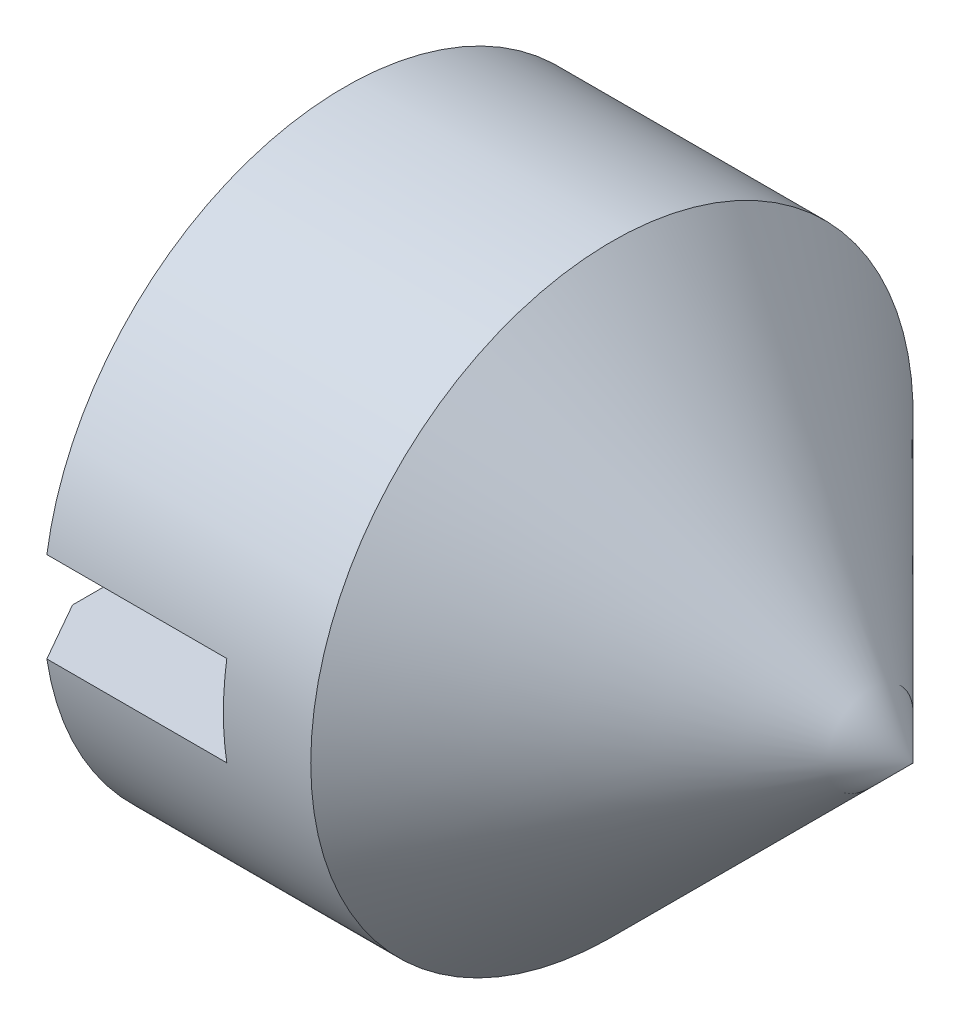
ISO-10303-21;
HEADER;
FILE_DESCRIPTION(('STEP AP214'),'2;1');
FILE_NAME('part.step','',(''),(''),'','','');
FILE_SCHEMA(('AUTOMOTIVE_DESIGN { 1 0 10303 214 1 1 1 1 }'));
ENDSEC;
DATA;
#1=APPLICATION_CONTEXT('core data for automotive mechanical design processes');
#2=APPLICATION_PROTOCOL_DEFINITION('international standard','automotive_design',2000,#1);
#3=PRODUCT_CONTEXT('',#1,'mechanical');
#4=PRODUCT('Part','Part','',(#3));
#5=PRODUCT_RELATED_PRODUCT_CATEGORY('part','',(#4));
#6=PRODUCT_DEFINITION_FORMATION('','',#4);
#7=PRODUCT_DEFINITION_CONTEXT('part definition',#1,'design');
#8=PRODUCT_DEFINITION('design','',#6,#7);
#9=PRODUCT_DEFINITION_SHAPE('','',#8);
#10=(LENGTH_UNIT() NAMED_UNIT(*) SI_UNIT(.MILLI.,.METRE.));
#11=(NAMED_UNIT(*) PLANE_ANGLE_UNIT() SI_UNIT($,.RADIAN.));
#12=(NAMED_UNIT(*) SI_UNIT($,.STERADIAN.) SOLID_ANGLE_UNIT());
#13=UNCERTAINTY_MEASURE_WITH_UNIT(LENGTH_MEASURE(1.E-05),#10,'distance_accuracy_value','');
#14=(GEOMETRIC_REPRESENTATION_CONTEXT(3) GLOBAL_UNCERTAINTY_ASSIGNED_CONTEXT((#13)) GLOBAL_UNIT_ASSIGNED_CONTEXT((#10,
#11,#12)) REPRESENTATION_CONTEXT('',''));
#15=CARTESIAN_POINT('',(0.,0.,0.));
#16=DIRECTION('',(0.,0.,1.));
#17=DIRECTION('',(1.,0.,0.));
#18=AXIS2_PLACEMENT_3D('',#15,#16,#17);
#19=CARTESIAN_POINT('',(0.,0.,0.));
#20=DIRECTION('',(-1.,0.,0.));
#21=DIRECTION('',(0.,0.,1.));
#22=AXIS2_PLACEMENT_3D('',#19,#20,#21);
#23=PLANE('',#22);
#24=CARTESIAN_POINT('',(0.,0.,0.));
#25=DIRECTION('',(-1.,0.,0.));
#26=DIRECTION('',(0.,0.,1.));
#27=AXIS2_PLACEMENT_3D('',#24,#25,#26);
#28=CIRCLE('',#27,1.61);
#29=CARTESIAN_POINT('',(0.,-0.3,-1.58180276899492));
#30=VERTEX_POINT('',#29);
#31=CARTESIAN_POINT('',(0.,-0.3,1.58180276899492));
#32=VERTEX_POINT('',#31);
#33=EDGE_CURVE('E158',#30,#32,#28,.T.);
#34=ORIENTED_EDGE('',*,*,#33,.T.);
#35=DIRECTION('',(0.,0.,-1.));
#36=VECTOR('',#35,1.);
#37=CARTESIAN_POINT('',(0.,-0.3,2.));
#38=LINE('',#37,#36);
#39=EDGE_CURVE('E114',#32,#30,#38,.T.);
#40=ORIENTED_EDGE('',*,*,#39,.T.);
#41=EDGE_LOOP('',(#34,#40));
#42=FACE_BOUND('',#41,.T.);
#43=ADVANCED_FACE('F35',(#42),#23,.T.);
#44=CARTESIAN_POINT('',(0.,0.,0.));
#45=DIRECTION('',(1.,0.,0.));
#46=DIRECTION('',(0.,0.,-1.));
#47=AXIS2_PLACEMENT_3D('',#44,#45,#46);
#48=CONICAL_SURFACE('',#47,1.61,1.0471975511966);
#49=CARTESIAN_POINT('',(0.225166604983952,0.,0.));
#50=DIRECTION('',(-1.,0.,0.));
#51=DIRECTION('',(0.,0.,1.));
#52=AXIS2_PLACEMENT_3D('',#49,#50,#51);
#53=CIRCLE('',#52,2.);
#54=CARTESIAN_POINT('',(0.225166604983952,-0.3,-1.97737199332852));
#55=VERTEX_POINT('',#54);
#56=CARTESIAN_POINT('',(0.225166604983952,-0.3,1.97737199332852));
#57=VERTEX_POINT('',#56);
#58=EDGE_CURVE('E163',#55,#57,#53,.T.);
#59=ORIENTED_EDGE('',*,*,#58,.T.);
#60=CARTESIAN_POINT('',(1.61900888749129,-0.299999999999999,4.4039994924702));
#61=CARTESIAN_POINT('',(1.51181694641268,-0.299999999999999,4.21790050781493));
#62=CARTESIAN_POINT('',(1.4046429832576,-0.299999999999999,4.03179115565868));
#63=CARTESIAN_POINT('',(1.19036671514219,-0.299999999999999,3.65952998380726));
#64=CARTESIAN_POINT('',(1.08326441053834,-0.3,3.47337816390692));
#65=CARTESIAN_POINT('',(0.869183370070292,-0.3,3.10103850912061));
#66=CARTESIAN_POINT('',(0.762204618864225,-0.3,2.9148506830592));
#67=CARTESIAN_POINT('',(0.548439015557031,-0.3,2.54236591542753));
#68=CARTESIAN_POINT('',(0.441652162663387,-0.3,2.35606897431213));
#69=CARTESIAN_POINT('',(0.229269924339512,-0.3,1.98473128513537));
#70=CARTESIAN_POINT('',(0.12367175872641,-0.3,1.79969212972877));
#71=CARTESIAN_POINT('',(-0.0340898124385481,-0.3,1.5217552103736));
#72=CARTESIAN_POINT('',(-0.0865745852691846,-0.3,1.42904025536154));
#73=CARTESIAN_POINT('',(-0.191153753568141,-0.3,1.24339386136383));
#74=CARTESIAN_POINT('',(-0.24324815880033,-0.3,1.15046242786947));
#75=CARTESIAN_POINT('',(-0.346871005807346,-0.3,0.963938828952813));
#76=CARTESIAN_POINT('',(-0.398397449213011,-0.3,0.870345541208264));
#77=CARTESIAN_POINT('',(-0.474367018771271,-0.3,0.729248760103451));
#78=CARTESIAN_POINT('',(-0.499469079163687,-0.3,0.68210085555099));
#79=CARTESIAN_POINT('',(-0.548908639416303,-0.3,0.587409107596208));
#80=CARTESIAN_POINT('',(-0.57324624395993,-0.3,0.539865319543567));
#81=CARTESIAN_POINT('',(-0.608769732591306,-0.3,0.467785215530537));
#82=CARTESIAN_POINT('',(-0.620498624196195,-0.3,0.443517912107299));
#83=CARTESIAN_POINT('',(-0.643407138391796,-0.3,0.39472655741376));
#84=CARTESIAN_POINT('',(-0.654586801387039,-0.3,0.370202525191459));
#85=CARTESIAN_POINT('',(-0.676156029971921,-0.3,0.320725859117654));
#86=CARTESIAN_POINT('',(-0.686543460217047,-0.3,0.295772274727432));
#87=CARTESIAN_POINT('',(-0.70603245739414,-0.3,0.245378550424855));
#88=CARTESIAN_POINT('',(-0.715134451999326,-0.3,0.219938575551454));
#89=CARTESIAN_POINT('',(-0.733754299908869,-0.3,0.160563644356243));
#90=CARTESIAN_POINT('',(-0.742567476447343,-0.3,0.12638360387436));
#91=CARTESIAN_POINT('',(-0.751318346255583,-0.3,0.0745063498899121));
#92=CARTESIAN_POINT('',(-0.753490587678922,-0.3,0.0571943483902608));
#93=CARTESIAN_POINT('',(-0.756129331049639,-0.3,0.0224398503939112));
#94=CARTESIAN_POINT('',(-0.756596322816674,-0.3,0.00499739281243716));
#95=CARTESIAN_POINT('',(-0.755763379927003,-0.3,-0.029890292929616));
#96=CARTESIAN_POINT('',(-0.754458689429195,-0.3,-0.0473354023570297));
#97=CARTESIAN_POINT('',(-0.750238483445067,-0.3,-0.0820313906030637));
#98=CARTESIAN_POINT('',(-0.747322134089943,-0.3,-0.0992821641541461));
#99=CARTESIAN_POINT('',(-0.740137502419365,-0.3,-0.133694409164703));
#100=CARTESIAN_POINT('',(-0.73585438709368,-0.3,-0.150852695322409));
#101=CARTESIAN_POINT('',(-0.726261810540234,-0.3,-0.184873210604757));
#102=CARTESIAN_POINT('',(-0.720952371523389,-0.3,-0.201735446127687));
#103=CARTESIAN_POINT('',(-0.702912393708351,-0.3,-0.254848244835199));
#104=CARTESIAN_POINT('',(-0.688787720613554,-0.3,-0.290618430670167));
#105=CARTESIAN_POINT('',(-0.65870973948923,-0.3,-0.361388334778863));
#106=CARTESIAN_POINT('',(-0.642754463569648,-0.3,-0.396387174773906));
#107=CARTESIAN_POINT('',(-0.609773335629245,-0.3,-0.46597733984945));
#108=CARTESIAN_POINT('',(-0.59274502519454,-0.3,-0.500567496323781));
#109=CARTESIAN_POINT('',(-0.558061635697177,-0.3,-0.56943334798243));
#110=CARTESIAN_POINT('',(-0.540406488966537,-0.3,-0.603709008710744));
#111=CARTESIAN_POINT('',(-0.486743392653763,-0.3,-0.706440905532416));
#112=CARTESIAN_POINT('',(-0.450143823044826,-0.3,-0.774587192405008));
#113=CARTESIAN_POINT('',(-0.376279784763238,-0.3,-0.910364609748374));
#114=CARTESIAN_POINT('',(-0.339016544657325,-0.3,-0.97799641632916));
#115=CARTESIAN_POINT('',(-0.261873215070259,-0.3,-1.11700666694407));
#116=CARTESIAN_POINT('',(-0.221968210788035,-0.3,-1.18837129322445));
#117=CARTESIAN_POINT('',(-0.141888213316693,-0.3,-1.33094841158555));
#118=CARTESIAN_POINT('',(-0.101713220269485,-0.3,-1.4021609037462));
#119=CARTESIAN_POINT('',(0.0190669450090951,-0.3,-1.61565940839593));
#120=CARTESIAN_POINT('',(0.0999249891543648,-0.3,-1.75780231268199));
#121=CARTESIAN_POINT('',(0.262019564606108,-0.3,-2.04202511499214));
#122=CARTESIAN_POINT('',(0.343256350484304,-0.3,-2.18410486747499));
#123=CARTESIAN_POINT('',(0.505908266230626,-0.3,-2.46816012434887));
#124=CARTESIAN_POINT('',(0.587323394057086,-0.3,-2.61013562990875));
#125=CARTESIAN_POINT('',(0.747879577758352,-0.3,-2.88987336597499));
#126=CARTESIAN_POINT('',(0.827017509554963,-0.3,-3.02763739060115));
#127=CARTESIAN_POINT('',(0.985361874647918,-0.3,-3.30312676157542));
#128=CARTESIAN_POINT('',(1.06456830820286,-0.3,-3.44085210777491));
#129=CARTESIAN_POINT('',(1.22296125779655,-0.3,-3.71615919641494));
#130=CARTESIAN_POINT('',(1.3021477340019,-0.3,-3.85374096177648));
#131=CARTESIAN_POINT('',(1.46055529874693,-0.3,-4.12888384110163));
#132=CARTESIAN_POINT('',(1.53977638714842,-0.300000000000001,-4.2664449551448));
#133=CARTESIAN_POINT('',(1.61900888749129,-0.300000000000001,-4.4039994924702));
#134=B_SPLINE_CURVE_WITH_KNOTS('',3,(#60,#61,#62,#63,#64,#65,#66,#67,#68,#69,#70,#71,#72,#73,
#74,#75,#76,#77,#78,#79,#80,#81,#82,#83,#84,#85,#86,#87,#88,#89,#90,#91,#92,#93,#94,#95,#96,#97,
#98,#99,#100,#101,#102,#103,#104,#105,#106,#107,#108,#109,#110,#111,#112,#113,#114,#115,#116,
#117,#118,#119,#120,#121,#122,#123,#124,#125,#126,#127,#128,#129,#130,#131,#132,#133),
.UNSPECIFIED.,.F.,.F.,(4,2,2,2,2,2,2,2,2,2,2,2,2,2,2,2,2,2,2,2,2,2,2,2,2,2,2,2,2,2,2,2,2,2,2,2,
4),(0.,0.644287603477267,1.28857838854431,1.9327779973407,2.57697493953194,3.21612511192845,
3.53574344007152,3.85535374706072,4.17586091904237,4.33609990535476,4.49631685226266,
4.57717121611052,4.658019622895,4.73907876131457,4.82011086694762,4.92561670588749,
4.97788731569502,5.03014290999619,5.08253905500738,5.13496233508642,5.18797508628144,
5.24098669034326,5.35623774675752,5.4716138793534,5.58726470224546,5.70292804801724,
5.93497334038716,6.16662637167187,6.41191639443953,6.65720628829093,7.14780029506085,
7.63879376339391,8.12978163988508,8.60641109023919,9.08304234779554,9.55927039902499,
10.0354965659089),.UNSPECIFIED.);
#135=EDGE_CURVE('E105',#57,#32,#134,.T.);
#136=ORIENTED_EDGE('',*,*,#135,.T.);
#137=ORIENTED_EDGE('',*,*,#33,.F.);
#138=EDGE_CURVE('E168',#30,#55,#134,.T.);
#139=ORIENTED_EDGE('',*,*,#138,.T.);
#140=EDGE_LOOP('',(#59,#136,#137,#139));
#141=FACE_BOUND('',#140,.T.);
#142=ADVANCED_FACE('F143',(#141),#48,.T.);
#143=CARTESIAN_POINT('',(-12.7,0.,0.));
#144=DIRECTION('',(-1.,0.,0.));
#145=DIRECTION('',(0.,0.,1.));
#146=AXIS2_PLACEMENT_3D('',#143,#144,#145);
#147=CYLINDRICAL_SURFACE('',#146,2.);
#148=CARTESIAN_POINT('',(2.00000000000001,0.,0.));
#149=DIRECTION('',(-1.,0.,0.));
#150=DIRECTION('',(0.,0.,1.));
#151=AXIS2_PLACEMENT_3D('',#148,#149,#150);
#152=CIRCLE('',#151,2.);
#153=CARTESIAN_POINT('',(2.00000000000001,0.,2.));
#154=VERTEX_POINT('',#153);
#155=EDGE_CURVE('E167',#154,#154,#152,.T.);
#156=ORIENTED_EDGE('',*,*,#155,.T.);
#157=EDGE_LOOP('',(#156));
#158=FACE_BOUND('',#157,.T.);
#159=ORIENTED_EDGE('',*,*,#58,.F.);
#160=DIRECTION('',(-1.,0.,0.));
#161=VECTOR('',#160,1.);
#162=CARTESIAN_POINT('',(-12.7,-0.3,-1.97737199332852));
#163=LINE('',#162,#161);
#164=CARTESIAN_POINT('',(1.42,-0.3,-1.97737199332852));
#165=VERTEX_POINT('',#164);
#166=EDGE_CURVE('E12',#55,#165,#163,.F.);
#167=ORIENTED_EDGE('',*,*,#166,.T.);
#168=CARTESIAN_POINT('',(1.42,0.,0.));
#169=DIRECTION('',(-1.,0.,0.));
#170=DIRECTION('',(0.,0.,1.));
#171=AXIS2_PLACEMENT_3D('',#168,#169,#170);
#172=CIRCLE('',#171,2.);
#173=CARTESIAN_POINT('',(1.42,0.299999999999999,-1.97737199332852));
#174=VERTEX_POINT('',#173);
#175=EDGE_CURVE('E101',#165,#174,#172,.F.);
#176=ORIENTED_EDGE('',*,*,#175,.T.);
#177=DIRECTION('',(-1.,0.,0.));
#178=VECTOR('',#177,1.);
#179=CARTESIAN_POINT('',(-12.7,0.299999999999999,-1.97737199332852));
#180=LINE('',#179,#178);
#181=CARTESIAN_POINT('',(0.225166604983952,0.299999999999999,-1.97737199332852));
#182=VERTEX_POINT('',#181);
#183=EDGE_CURVE('E43',#182,#174,#180,.F.);
#184=ORIENTED_EDGE('',*,*,#183,.F.);
#185=CARTESIAN_POINT('',(0.225166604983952,0.3,1.97737199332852));
#186=VERTEX_POINT('',#185);
#187=EDGE_CURVE('E159',#186,#182,#53,.T.);
#188=ORIENTED_EDGE('',*,*,#187,.F.);
#189=DIRECTION('',(-1.,0.,0.));
#190=VECTOR('',#189,1.);
#191=CARTESIAN_POINT('',(-12.7,0.3,1.97737199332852));
#192=LINE('',#191,#190);
#193=CARTESIAN_POINT('',(1.42,0.3,1.97737199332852));
#194=VERTEX_POINT('',#193);
#195=EDGE_CURVE('E94',#194,#186,#192,.T.);
#196=ORIENTED_EDGE('',*,*,#195,.F.);
#197=CARTESIAN_POINT('',(1.42,-0.3,1.97737199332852));
#198=VERTEX_POINT('',#197);
#199=EDGE_CURVE('E87',#194,#198,#172,.F.);
#200=ORIENTED_EDGE('',*,*,#199,.T.);
#201=DIRECTION('',(-1.,0.,0.));
#202=VECTOR('',#201,1.);
#203=CARTESIAN_POINT('',(-12.7,-0.3,1.97737199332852));
#204=LINE('',#203,#202);
#205=EDGE_CURVE('E91',#198,#57,#204,.T.);
#206=ORIENTED_EDGE('',*,*,#205,.T.);
#207=EDGE_LOOP('',(#159,#167,#176,#184,#188,#196,#200,#206));
#208=FACE_BOUND('',#207,.T.);
#209=ADVANCED_FACE('F90',(#158,#208),#147,.T.);
#210=DIRECTION('',(0.,0.,-1.));
#211=VECTOR('',#210,1.);
#212=CARTESIAN_POINT('',(0.,0.3,2.));
#213=LINE('',#212,#211);
#214=CARTESIAN_POINT('',(0.,0.3,1.58180276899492));
#215=VERTEX_POINT('',#214);
#216=CARTESIAN_POINT('',(0.,0.3,-1.58180276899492));
#217=VERTEX_POINT('',#216);
#218=EDGE_CURVE('E117',#215,#217,#213,.T.);
#219=ORIENTED_EDGE('',*,*,#218,.F.);
#220=EDGE_CURVE('E99',#215,#217,#28,.T.);
#221=ORIENTED_EDGE('',*,*,#220,.T.);
#222=EDGE_LOOP('',(#219,#221));
#223=FACE_BOUND('',#222,.T.);
#224=ADVANCED_FACE('F37',(#223),#23,.T.);
#225=CARTESIAN_POINT('',(1.61900888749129,0.3,4.4039994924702));
#226=CARTESIAN_POINT('',(1.51181694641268,0.3,4.21790050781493));
#227=CARTESIAN_POINT('',(1.4046429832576,0.3,4.03179115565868));
#228=CARTESIAN_POINT('',(1.19036671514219,0.3,3.65952998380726));
#229=CARTESIAN_POINT('',(1.08326441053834,0.3,3.47337816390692));
#230=CARTESIAN_POINT('',(0.86918337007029,0.3,3.10103850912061));
#231=CARTESIAN_POINT('',(0.762204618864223,0.3,2.91485068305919));
#232=CARTESIAN_POINT('',(0.548439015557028,0.3,2.54236591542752));
#233=CARTESIAN_POINT('',(0.441652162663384,0.3,2.35606897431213));
#234=CARTESIAN_POINT('',(0.229269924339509,0.3,1.98473128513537));
#235=CARTESIAN_POINT('',(0.123671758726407,0.3,1.79969212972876));
#236=CARTESIAN_POINT('',(-0.0340898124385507,0.3,1.52175521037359));
#237=CARTESIAN_POINT('',(-0.086574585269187,0.3,1.42904025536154));
#238=CARTESIAN_POINT('',(-0.191153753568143,0.3,1.24339386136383));
#239=CARTESIAN_POINT('',(-0.243248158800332,0.3,1.15046242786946));
#240=CARTESIAN_POINT('',(-0.346871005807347,0.3,0.963938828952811));
#241=CARTESIAN_POINT('',(-0.398397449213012,0.3,0.870345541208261));
#242=CARTESIAN_POINT('',(-0.474367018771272,0.3,0.729248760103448));
#243=CARTESIAN_POINT('',(-0.499469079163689,0.3,0.682100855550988));
#244=CARTESIAN_POINT('',(-0.548908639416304,0.3,0.587409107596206));
#245=CARTESIAN_POINT('',(-0.573246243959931,0.3,0.539865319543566));
#246=CARTESIAN_POINT('',(-0.608769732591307,0.3,0.467785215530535));
#247=CARTESIAN_POINT('',(-0.620498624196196,0.3,0.443517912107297));
#248=CARTESIAN_POINT('',(-0.643407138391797,0.3,0.394726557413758));
#249=CARTESIAN_POINT('',(-0.65458680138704,0.3,0.370202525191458));
#250=CARTESIAN_POINT('',(-0.676156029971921,0.3,0.320725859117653));
#251=CARTESIAN_POINT('',(-0.686543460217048,0.3,0.29577227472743));
#252=CARTESIAN_POINT('',(-0.70603245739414,0.3,0.245378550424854));
#253=CARTESIAN_POINT('',(-0.715134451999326,0.3,0.219938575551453));
#254=CARTESIAN_POINT('',(-0.733754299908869,0.3,0.160563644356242));
#255=CARTESIAN_POINT('',(-0.742567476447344,0.3,0.12638360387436));
#256=CARTESIAN_POINT('',(-0.751318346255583,0.3,0.0745063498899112));
#257=CARTESIAN_POINT('',(-0.753490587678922,0.3,0.0571943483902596));
#258=CARTESIAN_POINT('',(-0.756129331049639,0.3,0.02243985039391));
#259=CARTESIAN_POINT('',(-0.756596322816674,0.3,0.00499739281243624));
#260=CARTESIAN_POINT('',(-0.755763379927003,0.3,-0.0298902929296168));
#261=CARTESIAN_POINT('',(-0.754458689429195,0.3,-0.0473354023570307));
#262=CARTESIAN_POINT('',(-0.750238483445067,0.3,-0.0820313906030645));
#263=CARTESIAN_POINT('',(-0.747322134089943,0.3,-0.0992821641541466));
#264=CARTESIAN_POINT('',(-0.740137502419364,0.3,-0.133694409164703));
#265=CARTESIAN_POINT('',(-0.73585438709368,0.3,-0.15085269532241));
#266=CARTESIAN_POINT('',(-0.726261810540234,0.3,-0.184873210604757));
#267=CARTESIAN_POINT('',(-0.720952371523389,0.3,-0.201735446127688));
#268=CARTESIAN_POINT('',(-0.702912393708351,0.3,-0.254848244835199));
#269=CARTESIAN_POINT('',(-0.688787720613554,0.3,-0.290618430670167));
#270=CARTESIAN_POINT('',(-0.65870973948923,0.3,-0.361388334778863));
#271=CARTESIAN_POINT('',(-0.642754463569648,0.3,-0.396387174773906));
#272=CARTESIAN_POINT('',(-0.609773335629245,0.3,-0.465977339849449));
#273=CARTESIAN_POINT('',(-0.59274502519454,0.3,-0.500567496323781));
#274=CARTESIAN_POINT('',(-0.558061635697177,0.3,-0.56943334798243));
#275=CARTESIAN_POINT('',(-0.540406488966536,0.3,-0.603709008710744));
#276=CARTESIAN_POINT('',(-0.486743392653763,0.3,-0.706440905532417));
#277=CARTESIAN_POINT('',(-0.450143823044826,0.3,-0.774587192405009));
#278=CARTESIAN_POINT('',(-0.376279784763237,0.3,-0.910364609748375));
#279=CARTESIAN_POINT('',(-0.339016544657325,0.3,-0.977996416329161));
#280=CARTESIAN_POINT('',(-0.261873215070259,0.3,-1.11700666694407));
#281=CARTESIAN_POINT('',(-0.221968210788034,0.3,-1.18837129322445));
#282=CARTESIAN_POINT('',(-0.141888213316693,0.3,-1.33094841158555));
#283=CARTESIAN_POINT('',(-0.101713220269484,0.3,-1.4021609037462));
#284=CARTESIAN_POINT('',(0.0190669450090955,0.3,-1.61565940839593));
#285=CARTESIAN_POINT('',(0.0999249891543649,0.3,-1.75780231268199));
#286=CARTESIAN_POINT('',(0.262019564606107,0.299999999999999,-2.04202511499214));
#287=CARTESIAN_POINT('',(0.343256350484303,0.299999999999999,-2.18410486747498));
#288=CARTESIAN_POINT('',(0.505908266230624,0.299999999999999,-2.46816012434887));
#289=CARTESIAN_POINT('',(0.587323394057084,0.299999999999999,-2.61013562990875));
#290=CARTESIAN_POINT('',(0.74787957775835,0.299999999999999,-2.88987336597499));
#291=CARTESIAN_POINT('',(0.827017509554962,0.299999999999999,-3.02763739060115));
#292=CARTESIAN_POINT('',(0.985361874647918,0.299999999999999,-3.30312676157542));
#293=CARTESIAN_POINT('',(1.06456830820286,0.299999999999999,-3.44085210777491));
#294=CARTESIAN_POINT('',(1.22296125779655,0.299999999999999,-3.71615919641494));
#295=CARTESIAN_POINT('',(1.3021477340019,0.299999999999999,-3.85374096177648));
#296=CARTESIAN_POINT('',(1.46055529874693,0.299999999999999,-4.12888384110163));
#297=CARTESIAN_POINT('',(1.53977638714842,0.299999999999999,-4.2664449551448));
#298=CARTESIAN_POINT('',(1.61900888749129,0.299999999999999,-4.4039994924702));
#299=B_SPLINE_CURVE_WITH_KNOTS('',3,(#225,#226,#227,#228,#229,#230,#231,#232,#233,#234,#235,
#236,#237,#238,#239,#240,#241,#242,#243,#244,#245,#246,#247,#248,#249,#250,#251,#252,#253,#254,
#255,#256,#257,#258,#259,#260,#261,#262,#263,#264,#265,#266,#267,#268,#269,#270,#271,#272,#273,
#274,#275,#276,#277,#278,#279,#280,#281,#282,#283,#284,#285,#286,#287,#288,#289,#290,#291,#292,
#293,#294,#295,#296,#297,#298),.UNSPECIFIED.,.F.,.F.,(4,2,2,2,2,2,2,2,2,2,2,2,2,2,2,2,2,2,2,2,2,
2,2,2,2,2,2,2,2,2,2,2,2,2,2,2,4),(0.,0.64428760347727,1.28857838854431,1.93277799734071,
2.57697493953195,3.21612511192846,3.53574344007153,3.85535374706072,4.17586091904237,
4.33609990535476,4.49631685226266,4.57717121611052,4.658019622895,4.73907876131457,
4.82011086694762,4.92561670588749,4.97788731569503,5.03014290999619,5.08253905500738,
5.13496233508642,5.18797508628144,5.24098669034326,5.35623774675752,5.4716138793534,
5.58726470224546,5.70292804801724,5.93497334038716,6.16662637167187,6.41191639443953,
6.65720628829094,7.14780029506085,7.63879376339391,8.12978163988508,8.60641109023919,
9.08304234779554,9.55927039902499,10.0354965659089),.UNSPECIFIED.);
#300=EDGE_CURVE('E109',#186,#215,#299,.T.);
#301=ORIENTED_EDGE('',*,*,#300,.F.);
#302=ORIENTED_EDGE('',*,*,#187,.T.);
#303=EDGE_CURVE('E112',#217,#182,#299,.T.);
#304=ORIENTED_EDGE('',*,*,#303,.F.);
#305=ORIENTED_EDGE('',*,*,#220,.F.);
#306=EDGE_LOOP('',(#301,#302,#304,#305));
#307=FACE_BOUND('',#306,.T.);
#308=ADVANCED_FACE('F130',(#307),#48,.T.);
#309=CARTESIAN_POINT('',(2.00000000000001,0.,0.));
#310=DIRECTION('',(-1.,0.,0.));
#311=DIRECTION('',(0.,0.,1.));
#312=AXIS2_PLACEMENT_3D('',#309,#310,#311);
#313=CONICAL_SURFACE('',#312,2.,0.78539816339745);
#314=CARTESIAN_POINT('',(4.,0.,0.));
#315=VERTEX_POINT('',#314);
#316=VERTEX_LOOP('',#315);
#317=FACE_BOUND('',#316,.T.);
#318=ORIENTED_EDGE('',*,*,#155,.F.);
#319=EDGE_LOOP('',(#318));
#320=FACE_BOUND('',#319,.T.);
#321=ADVANCED_FACE('F140',(#317,#320),#313,.T.);
#322=CARTESIAN_POINT('',(1.42,-0.3,2.));
#323=DIRECTION('',(0.,1.,0.));
#324=DIRECTION('',(0.,0.,1.));
#325=AXIS2_PLACEMENT_3D('',#322,#323,#324);
#326=PLANE('',#325);
#327=ORIENTED_EDGE('',*,*,#39,.F.);
#328=ORIENTED_EDGE('',*,*,#135,.F.);
#329=ORIENTED_EDGE('',*,*,#205,.F.);
#330=DIRECTION('',(0.,0.,-1.));
#331=VECTOR('',#330,1.);
#332=CARTESIAN_POINT('',(1.42,-0.3,2.));
#333=LINE('',#332,#331);
#334=EDGE_CURVE('E103',#198,#165,#333,.T.);
#335=ORIENTED_EDGE('',*,*,#334,.T.);
#336=ORIENTED_EDGE('',*,*,#166,.F.);
#337=ORIENTED_EDGE('',*,*,#138,.F.);
#338=EDGE_LOOP('',(#327,#328,#329,#335,#336,#337));
#339=FACE_BOUND('',#338,.T.);
#340=ADVANCED_FACE('F102',(#339),#326,.T.);
#341=CARTESIAN_POINT('',(1.42,0.3,2.));
#342=DIRECTION('',(0.,1.,0.));
#343=DIRECTION('',(0.,0.,1.));
#344=AXIS2_PLACEMENT_3D('',#341,#342,#343);
#345=PLANE('',#344);
#346=ORIENTED_EDGE('',*,*,#303,.T.);
#347=ORIENTED_EDGE('',*,*,#183,.T.);
#348=DIRECTION('',(0.,0.,-1.));
#349=VECTOR('',#348,1.);
#350=CARTESIAN_POINT('',(1.42,0.3,2.));
#351=LINE('',#350,#349);
#352=EDGE_CURVE('E110',#194,#174,#351,.T.);
#353=ORIENTED_EDGE('',*,*,#352,.F.);
#354=ORIENTED_EDGE('',*,*,#195,.T.);
#355=ORIENTED_EDGE('',*,*,#300,.T.);
#356=ORIENTED_EDGE('',*,*,#218,.T.);
#357=EDGE_LOOP('',(#346,#347,#353,#354,#355,#356));
#358=FACE_BOUND('',#357,.T.);
#359=ADVANCED_FACE('F133',(#358),#345,.F.);
#360=CARTESIAN_POINT('',(1.42,-0.3,2.));
#361=DIRECTION('',(-1.,0.,0.));
#362=DIRECTION('',(0.,0.,1.));
#363=AXIS2_PLACEMENT_3D('',#360,#361,#362);
#364=PLANE('',#363);
#365=ORIENTED_EDGE('',*,*,#334,.F.);
#366=ORIENTED_EDGE('',*,*,#199,.F.);
#367=ORIENTED_EDGE('',*,*,#352,.T.);
#368=ORIENTED_EDGE('',*,*,#175,.F.);
#369=EDGE_LOOP('',(#365,#366,#367,#368));
#370=FACE_BOUND('',#369,.T.);
#371=ADVANCED_FACE('F107',(#370),#364,.T.);
#372=CLOSED_SHELL('',(#43,#142,#209,#224,#308,#321,#340,#359,#371));
#373=MANIFOLD_SOLID_BREP('B2',#372);
#374=ADVANCED_BREP_SHAPE_REPRESENTATION('',(#18,#373),#14);
#375=SHAPE_DEFINITION_REPRESENTATION(#9,#374);
ENDSEC;
END-ISO-10303-21;
